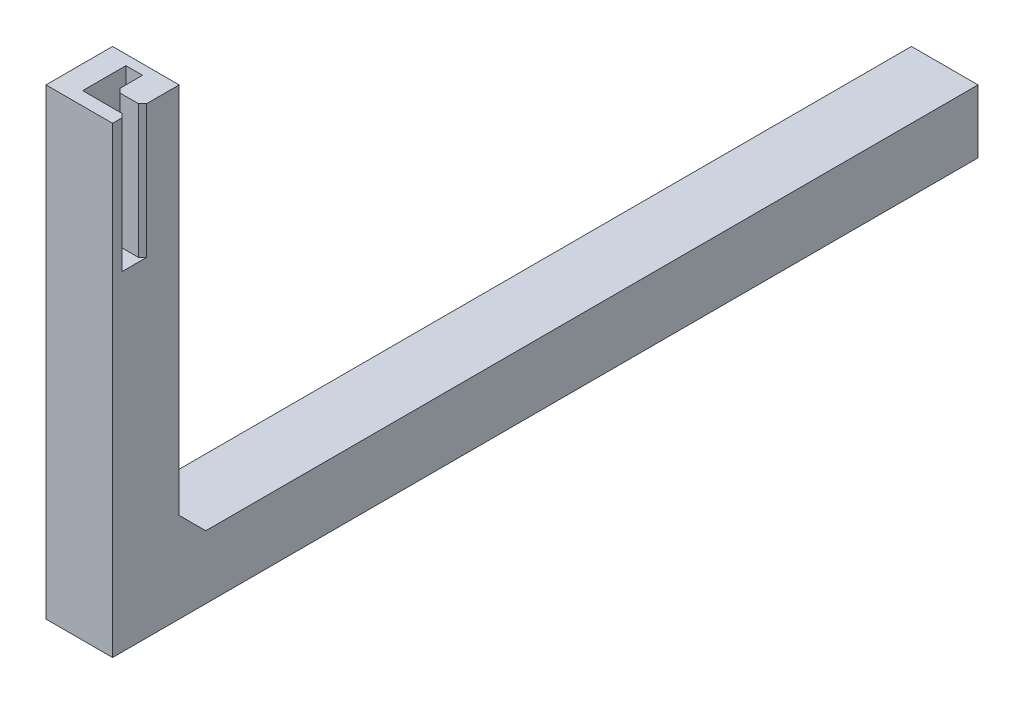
ISO-10303-21;
HEADER;
FILE_DESCRIPTION(('STEP AP214'),'2;1');
FILE_NAME('part.step','',(''),(''),'','','');
FILE_SCHEMA(('AUTOMOTIVE_DESIGN { 1 0 10303 214 1 1 1 1 }'));
ENDSEC;
DATA;
#1=APPLICATION_CONTEXT('core data for automotive mechanical design processes');
#2=APPLICATION_PROTOCOL_DEFINITION('international standard','automotive_design',2000,#1);
#3=PRODUCT_CONTEXT('',#1,'mechanical');
#4=PRODUCT('Part','Part','',(#3));
#5=PRODUCT_RELATED_PRODUCT_CATEGORY('part','',(#4));
#6=PRODUCT_DEFINITION_FORMATION('','',#4);
#7=PRODUCT_DEFINITION_CONTEXT('part definition',#1,'design');
#8=PRODUCT_DEFINITION('design','',#6,#7);
#9=PRODUCT_DEFINITION_SHAPE('','',#8);
#10=(LENGTH_UNIT() NAMED_UNIT(*) SI_UNIT(.MILLI.,.METRE.));
#11=(NAMED_UNIT(*) PLANE_ANGLE_UNIT() SI_UNIT($,.RADIAN.));
#12=(NAMED_UNIT(*) SI_UNIT($,.STERADIAN.) SOLID_ANGLE_UNIT());
#13=UNCERTAINTY_MEASURE_WITH_UNIT(LENGTH_MEASURE(1.E-05),#10,'distance_accuracy_value','');
#14=(GEOMETRIC_REPRESENTATION_CONTEXT(3) GLOBAL_UNCERTAINTY_ASSIGNED_CONTEXT((#13)) GLOBAL_UNIT_ASSIGNED_CONTEXT((#10,
#11,#12)) REPRESENTATION_CONTEXT('',''));
#15=CARTESIAN_POINT('',(0.,0.,0.));
#16=DIRECTION('',(0.,0.,1.));
#17=DIRECTION('',(1.,0.,0.));
#18=AXIS2_PLACEMENT_3D('',#15,#16,#17);
#19=CARTESIAN_POINT('',(-10.,0.,-130.));
#20=DIRECTION('',(0.,-1.,0.));
#21=DIRECTION('',(0.,0.,-1.));
#22=AXIS2_PLACEMENT_3D('',#19,#20,#21);
#23=PLANE('',#22);
#24=DIRECTION('',(0.,0.,-1.));
#25=VECTOR('',#24,1.);
#26=CARTESIAN_POINT('',(-9.5,0.,-130.));
#27=LINE('',#26,#25);
#28=CARTESIAN_POINT('',(-9.5,0.,-0.5));
#29=VERTEX_POINT('',#28);
#30=CARTESIAN_POINT('',(-9.5,0.,-129.5));
#31=VERTEX_POINT('',#30);
#32=EDGE_CURVE('E299',#29,#31,#27,.T.);
#33=ORIENTED_EDGE('',*,*,#32,.T.);
#34=DIRECTION('',(1.,0.,0.));
#35=VECTOR('',#34,1.);
#36=CARTESIAN_POINT('',(-10.,0.,-129.5));
#37=LINE('',#36,#35);
#38=CARTESIAN_POINT('',(-0.5,0.,-129.5));
#39=VERTEX_POINT('',#38);
#40=EDGE_CURVE('E302',#31,#39,#37,.T.);
#41=ORIENTED_EDGE('',*,*,#40,.T.);
#42=DIRECTION('',(0.,0.,1.));
#43=VECTOR('',#42,1.);
#44=CARTESIAN_POINT('',(-0.5,0.,0.));
#45=LINE('',#44,#43);
#46=CARTESIAN_POINT('',(-0.5,0.,-0.5));
#47=VERTEX_POINT('',#46);
#48=EDGE_CURVE('E293',#39,#47,#45,.T.);
#49=ORIENTED_EDGE('',*,*,#48,.T.);
#50=DIRECTION('',(-1.,0.,0.));
#51=VECTOR('',#50,1.);
#52=CARTESIAN_POINT('',(-10.,0.,-0.5));
#53=LINE('',#52,#51);
#54=EDGE_CURVE('E296',#47,#29,#53,.T.);
#55=ORIENTED_EDGE('',*,*,#54,.T.);
#56=EDGE_LOOP('',(#33,#41,#49,#55));
#57=FACE_BOUND('',#56,.T.);
#58=ADVANCED_FACE('F41',(#57),#23,.T.);
#59=CARTESIAN_POINT('',(-10.,0.,0.));
#60=DIRECTION('',(0.,0.,1.));
#61=DIRECTION('',(1.,0.,0.));
#62=AXIS2_PLACEMENT_3D('',#59,#60,#61);
#63=PLANE('',#62);
#64=DIRECTION('',(0.,-1.,0.));
#65=VECTOR('',#64,1.);
#66=CARTESIAN_POINT('',(-10.,0.,0.));
#67=LINE('',#66,#65);
#68=CARTESIAN_POINT('',(-10.,70.,0.));
#69=VERTEX_POINT('',#68);
#70=CARTESIAN_POINT('',(-10.,0.499999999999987,0.));
#71=VERTEX_POINT('',#70);
#72=EDGE_CURVE('E245',#69,#71,#67,.T.);
#73=ORIENTED_EDGE('',*,*,#72,.T.);
#74=DIRECTION('',(1.,0.,0.));
#75=VECTOR('',#74,1.);
#76=CARTESIAN_POINT('',(-10.,0.499999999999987,0.));
#77=LINE('',#76,#75);
#78=CARTESIAN_POINT('',(0.,0.499999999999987,0.));
#79=VERTEX_POINT('',#78);
#80=EDGE_CURVE('E313',#71,#79,#77,.T.);
#81=ORIENTED_EDGE('',*,*,#80,.T.);
#82=DIRECTION('',(0.,-1.,0.));
#83=VECTOR('',#82,1.);
#84=CARTESIAN_POINT('',(0.,0.,0.));
#85=LINE('',#84,#83);
#86=CARTESIAN_POINT('',(0.,70.,0.));
#87=VERTEX_POINT('',#86);
#88=EDGE_CURVE('E234',#87,#79,#85,.T.);
#89=ORIENTED_EDGE('',*,*,#88,.F.);
#90=DIRECTION('',(1.,0.,0.));
#91=VECTOR('',#90,1.);
#92=CARTESIAN_POINT('',(-10.,70.,0.));
#93=LINE('',#92,#91);
#94=EDGE_CURVE('E269',#69,#87,#93,.T.);
#95=ORIENTED_EDGE('',*,*,#94,.F.);
#96=EDGE_LOOP('',(#73,#81,#89,#95));
#97=FACE_BOUND('',#96,.T.);
#98=ADVANCED_FACE('F375',(#97),#63,.T.);
#99=CARTESIAN_POINT('',(-10.,70.,0.));
#100=DIRECTION('',(0.,1.,0.));
#101=DIRECTION('',(0.,0.,1.));
#102=AXIS2_PLACEMENT_3D('',#99,#100,#101);
#103=PLANE('',#102);
#104=DIRECTION('',(0.,0.,-1.));
#105=VECTOR('',#104,1.);
#106=CARTESIAN_POINT('',(-4.,70.,-8.5));
#107=LINE('',#106,#105);
#108=CARTESIAN_POINT('',(-4.,70.,-5.1));
#109=VERTEX_POINT('',#108);
#110=CARTESIAN_POINT('',(-4.,70.,-8.5));
#111=VERTEX_POINT('',#110);
#112=EDGE_CURVE('E189',#109,#111,#107,.T.);
#113=ORIENTED_EDGE('',*,*,#112,.F.);
#114=DIRECTION('',(-0.707106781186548,0.,-0.707106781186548));
#115=VECTOR('',#114,1.);
#116=CARTESIAN_POINT('',(-4.45,70.,-5.55));
#117=LINE('',#116,#115);
#118=CARTESIAN_POINT('',(-3.4,70.,-4.5));
#119=VERTEX_POINT('',#118);
#120=EDGE_CURVE('E340',#109,#119,#117,.F.);
#121=ORIENTED_EDGE('',*,*,#120,.T.);
#122=DIRECTION('',(-1.,0.,0.));
#123=VECTOR('',#122,1.);
#124=CARTESIAN_POINT('',(-4.,70.,-4.5));
#125=LINE('',#124,#123);
#126=CARTESIAN_POINT('',(-0.599999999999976,70.,-4.5));
#127=VERTEX_POINT('',#126);
#128=EDGE_CURVE('E208',#127,#119,#125,.T.);
#129=ORIENTED_EDGE('',*,*,#128,.F.);
#130=DIRECTION('',(-0.707106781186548,0.,0.707106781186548));
#131=VECTOR('',#130,1.);
#132=CARTESIAN_POINT('',(-7.54999999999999,70.,2.45000000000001));
#133=LINE('',#132,#131);
#134=CARTESIAN_POINT('',(0.,70.,-5.09999999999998));
#135=VERTEX_POINT('',#134);
#136=EDGE_CURVE('E334',#127,#135,#133,.F.);
#137=ORIENTED_EDGE('',*,*,#136,.T.);
#138=DIRECTION('',(0.,0.,1.));
#139=VECTOR('',#138,1.);
#140=CARTESIAN_POINT('',(0.,70.,0.));
#141=LINE('',#140,#139);
#142=CARTESIAN_POINT('',(0.,70.,-10.));
#143=VERTEX_POINT('',#142);
#144=EDGE_CURVE('E262',#143,#135,#141,.T.);
#145=ORIENTED_EDGE('',*,*,#144,.F.);
#146=DIRECTION('',(1.,0.,0.));
#147=VECTOR('',#146,1.);
#148=CARTESIAN_POINT('',(-10.,70.,-10.));
#149=LINE('',#148,#147);
#150=CARTESIAN_POINT('',(-10.,70.,-10.));
#151=VERTEX_POINT('',#150);
#152=EDGE_CURVE('E274',#151,#143,#149,.T.);
#153=ORIENTED_EDGE('',*,*,#152,.F.);
#154=DIRECTION('',(0.,0.,1.));
#155=VECTOR('',#154,1.);
#156=CARTESIAN_POINT('',(-10.,70.,0.));
#157=LINE('',#156,#155);
#158=EDGE_CURVE('E241',#151,#69,#157,.T.);
#159=ORIENTED_EDGE('',*,*,#158,.T.);
#160=ORIENTED_EDGE('',*,*,#94,.T.);
#161=CARTESIAN_POINT('',(0.,70.,-1.4));
#162=VERTEX_POINT('',#161);
#163=EDGE_CURVE('E261',#162,#87,#141,.T.);
#164=ORIENTED_EDGE('',*,*,#163,.F.);
#165=DIRECTION('',(0.707106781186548,0.,0.707106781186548));
#166=VECTOR('',#165,1.);
#167=CARTESIAN_POINT('',(-4.3,70.,-5.7));
#168=LINE('',#167,#166);
#169=CARTESIAN_POINT('',(-0.600000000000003,70.,-2.));
#170=VERTEX_POINT('',#169);
#171=EDGE_CURVE('E337',#162,#170,#168,.F.);
#172=ORIENTED_EDGE('',*,*,#171,.T.);
#173=DIRECTION('',(1.,0.,0.));
#174=VECTOR('',#173,1.);
#175=CARTESIAN_POINT('',(0.,70.,-2.));
#176=LINE('',#175,#174);
#177=CARTESIAN_POINT('',(-6.5,70.,-2.));
#178=VERTEX_POINT('',#177);
#179=EDGE_CURVE('E221',#178,#170,#176,.T.);
#180=ORIENTED_EDGE('',*,*,#179,.F.);
#181=DIRECTION('',(0.,0.,1.));
#182=VECTOR('',#181,1.);
#183=CARTESIAN_POINT('',(-6.5,70.,-2.));
#184=LINE('',#183,#182);
#185=CARTESIAN_POINT('',(-6.5,70.,-8.5));
#186=VERTEX_POINT('',#185);
#187=EDGE_CURVE('E217',#186,#178,#184,.T.);
#188=ORIENTED_EDGE('',*,*,#187,.F.);
#189=DIRECTION('',(-1.,0.,0.));
#190=VECTOR('',#189,1.);
#191=CARTESIAN_POINT('',(-6.5,70.,-8.5));
#192=LINE('',#191,#190);
#193=EDGE_CURVE('E214',#111,#186,#192,.T.);
#194=ORIENTED_EDGE('',*,*,#193,.F.);
#195=EDGE_LOOP('',(#113,#121,#129,#137,#145,#153,#159,#160,#164,#172,#180,#188,#194));
#196=FACE_BOUND('',#195,.T.);
#197=ADVANCED_FACE('F367',(#196),#103,.T.);
#198=CARTESIAN_POINT('',(-10.,70.,-10.));
#199=DIRECTION('',(0.,0.,-1.));
#200=DIRECTION('',(0.,1.,0.));
#201=AXIS2_PLACEMENT_3D('',#198,#199,#200);
#202=PLANE('',#201);
#203=DIRECTION('',(0.,1.,0.));
#204=VECTOR('',#203,1.);
#205=CARTESIAN_POINT('',(0.,70.,-10.));
#206=LINE('',#205,#204);
#207=CARTESIAN_POINT('',(0.,14.,-10.));
#208=VERTEX_POINT('',#207);
#209=EDGE_CURVE('E258',#208,#143,#206,.T.);
#210=ORIENTED_EDGE('',*,*,#209,.F.);
#211=DIRECTION('',(-1.,0.,0.));
#212=VECTOR('',#211,1.);
#213=CARTESIAN_POINT('',(-10.,14.,-10.));
#214=LINE('',#213,#212);
#215=CARTESIAN_POINT('',(-10.,14.,-10.));
#216=VERTEX_POINT('',#215);
#217=EDGE_CURVE('E284',#208,#216,#214,.T.);
#218=ORIENTED_EDGE('',*,*,#217,.T.);
#219=DIRECTION('',(0.,1.,0.));
#220=VECTOR('',#219,1.);
#221=CARTESIAN_POINT('',(-10.,70.,-10.));
#222=LINE('',#221,#220);
#223=EDGE_CURVE('E238',#216,#151,#222,.T.);
#224=ORIENTED_EDGE('',*,*,#223,.T.);
#225=ORIENTED_EDGE('',*,*,#152,.T.);
#226=EDGE_LOOP('',(#210,#218,#224,#225));
#227=FACE_BOUND('',#226,.T.);
#228=ADVANCED_FACE('F412',(#227),#202,.T.);
#229=CARTESIAN_POINT('',(-10.,10.,-10.));
#230=DIRECTION('',(0.,1.,0.));
#231=DIRECTION('',(0.,0.,1.));
#232=AXIS2_PLACEMENT_3D('',#229,#230,#231);
#233=PLANE('',#232);
#234=DIRECTION('',(0.,0.,1.));
#235=VECTOR('',#234,1.);
#236=CARTESIAN_POINT('',(-10.,10.,-10.));
#237=LINE('',#236,#235);
#238=CARTESIAN_POINT('',(-10.,10.,-130.));
#239=VERTEX_POINT('',#238);
#240=CARTESIAN_POINT('',(-10.,10.,-14.));
#241=VERTEX_POINT('',#240);
#242=EDGE_CURVE('E233',#239,#241,#237,.T.);
#243=ORIENTED_EDGE('',*,*,#242,.T.);
#244=DIRECTION('',(1.,0.,0.));
#245=VECTOR('',#244,1.);
#246=CARTESIAN_POINT('',(0.,10.,-14.));
#247=LINE('',#246,#245);
#248=CARTESIAN_POINT('',(0.,10.,-14.));
#249=VERTEX_POINT('',#248);
#250=EDGE_CURVE('E273',#241,#249,#247,.T.);
#251=ORIENTED_EDGE('',*,*,#250,.T.);
#252=DIRECTION('',(0.,0.,1.));
#253=VECTOR('',#252,1.);
#254=CARTESIAN_POINT('',(0.,10.,-10.));
#255=LINE('',#254,#253);
#256=CARTESIAN_POINT('',(0.,10.,-130.));
#257=VERTEX_POINT('',#256);
#258=EDGE_CURVE('E253',#257,#249,#255,.T.);
#259=ORIENTED_EDGE('',*,*,#258,.F.);
#260=DIRECTION('',(1.,0.,0.));
#261=VECTOR('',#260,1.);
#262=CARTESIAN_POINT('',(-10.,10.,-130.));
#263=LINE('',#262,#261);
#264=EDGE_CURVE('E249',#239,#257,#263,.T.);
#265=ORIENTED_EDGE('',*,*,#264,.F.);
#266=EDGE_LOOP('',(#243,#251,#259,#265));
#267=FACE_BOUND('',#266,.T.);
#268=ADVANCED_FACE('F405',(#267),#233,.T.);
#269=CARTESIAN_POINT('',(-10.,10.,-130.));
#270=DIRECTION('',(0.,0.,-1.));
#271=DIRECTION('',(-1.,0.,0.));
#272=AXIS2_PLACEMENT_3D('',#269,#270,#271);
#273=PLANE('',#272);
#274=DIRECTION('',(0.,1.,0.));
#275=VECTOR('',#274,1.);
#276=CARTESIAN_POINT('',(0.,10.,-130.));
#277=LINE('',#276,#275);
#278=CARTESIAN_POINT('',(0.,0.499999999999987,-130.));
#279=VERTEX_POINT('',#278);
#280=EDGE_CURVE('E250',#279,#257,#277,.T.);
#281=ORIENTED_EDGE('',*,*,#280,.F.);
#282=DIRECTION('',(-1.,0.,0.));
#283=VECTOR('',#282,1.);
#284=CARTESIAN_POINT('',(-10.,0.499999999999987,-130.));
#285=LINE('',#284,#283);
#286=CARTESIAN_POINT('',(-10.,0.499999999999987,-130.));
#287=VERTEX_POINT('',#286);
#288=EDGE_CURVE('E306',#279,#287,#285,.T.);
#289=ORIENTED_EDGE('',*,*,#288,.T.);
#290=DIRECTION('',(0.,1.,0.));
#291=VECTOR('',#290,1.);
#292=CARTESIAN_POINT('',(-10.,10.,-130.));
#293=LINE('',#292,#291);
#294=EDGE_CURVE('E230',#287,#239,#293,.T.);
#295=ORIENTED_EDGE('',*,*,#294,.T.);
#296=ORIENTED_EDGE('',*,*,#264,.T.);
#297=EDGE_LOOP('',(#281,#289,#295,#296));
#298=FACE_BOUND('',#297,.T.);
#299=ADVANCED_FACE('F396',(#298),#273,.T.);
#300=CARTESIAN_POINT('',(-10.,0.,0.));
#301=DIRECTION('',(-1.,0.,0.));
#302=DIRECTION('',(0.,0.,1.));
#303=AXIS2_PLACEMENT_3D('',#300,#301,#302);
#304=PLANE('',#303);
#305=ORIENTED_EDGE('',*,*,#294,.F.);
#306=DIRECTION('',(0.,0.,1.));
#307=VECTOR('',#306,1.);
#308=CARTESIAN_POINT('',(-10.,0.499999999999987,0.));
#309=LINE('',#308,#307);
#310=EDGE_CURVE('E310',#287,#71,#309,.T.);
#311=ORIENTED_EDGE('',*,*,#310,.T.);
#312=ORIENTED_EDGE('',*,*,#72,.F.);
#313=ORIENTED_EDGE('',*,*,#158,.F.);
#314=ORIENTED_EDGE('',*,*,#223,.F.);
#315=DIRECTION('',(0.,0.707106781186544,0.707106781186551));
#316=VECTOR('',#315,1.);
#317=CARTESIAN_POINT('',(-10.,10.,-14.));
#318=LINE('',#317,#316);
#319=EDGE_CURVE('E290',#216,#241,#318,.F.);
#320=ORIENTED_EDGE('',*,*,#319,.T.);
#321=ORIENTED_EDGE('',*,*,#242,.F.);
#322=EDGE_LOOP('',(#305,#311,#312,#313,#314,#320,#321));
#323=FACE_BOUND('',#322,.T.);
#324=ADVANCED_FACE('F400',(#323),#304,.T.);
#325=CARTESIAN_POINT('',(0.,0.,0.));
#326=DIRECTION('',(-1.,0.,0.));
#327=DIRECTION('',(0.,0.,1.));
#328=AXIS2_PLACEMENT_3D('',#325,#326,#327);
#329=PLANE('',#328);
#330=DIRECTION('',(0.,0.,-1.));
#331=VECTOR('',#330,1.);
#332=CARTESIAN_POINT('',(0.,50.,-4.5));
#333=LINE('',#332,#331);
#334=CARTESIAN_POINT('',(0.,50.,-1.4));
#335=VERTEX_POINT('',#334);
#336=CARTESIAN_POINT('',(0.,50.,-5.09999999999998));
#337=VERTEX_POINT('',#336);
#338=EDGE_CURVE('E66',#335,#337,#333,.T.);
#339=ORIENTED_EDGE('',*,*,#338,.F.);
#340=DIRECTION('',(0.,1.,0.));
#341=VECTOR('',#340,1.);
#342=CARTESIAN_POINT('',(0.,0.,-1.4));
#343=LINE('',#342,#341);
#344=EDGE_CURVE('E353',#335,#162,#343,.T.);
#345=ORIENTED_EDGE('',*,*,#344,.T.);
#346=ORIENTED_EDGE('',*,*,#163,.T.);
#347=ORIENTED_EDGE('',*,*,#88,.T.);
#348=DIRECTION('',(0.,0.,-1.));
#349=VECTOR('',#348,1.);
#350=CARTESIAN_POINT('',(0.,0.499999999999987,-130.));
#351=LINE('',#350,#349);
#352=EDGE_CURVE('E316',#79,#279,#351,.T.);
#353=ORIENTED_EDGE('',*,*,#352,.T.);
#354=ORIENTED_EDGE('',*,*,#280,.T.);
#355=ORIENTED_EDGE('',*,*,#258,.T.);
#356=DIRECTION('',(0.,-0.707106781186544,-0.707106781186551));
#357=VECTOR('',#356,1.);
#358=CARTESIAN_POINT('',(0.,12.0000000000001,-12.));
#359=LINE('',#358,#357);
#360=EDGE_CURVE('E287',#249,#208,#359,.F.);
#361=ORIENTED_EDGE('',*,*,#360,.T.);
#362=ORIENTED_EDGE('',*,*,#209,.T.);
#363=ORIENTED_EDGE('',*,*,#144,.T.);
#364=DIRECTION('',(0.,-1.,0.));
#365=VECTOR('',#364,1.);
#366=CARTESIAN_POINT('',(0.,0.,-5.09999999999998));
#367=LINE('',#366,#365);
#368=EDGE_CURVE('E350',#135,#337,#367,.T.);
#369=ORIENTED_EDGE('',*,*,#368,.T.);
#370=EDGE_LOOP('',(#339,#345,#346,#347,#353,#354,#355,#361,#362,#363,#369));
#371=FACE_BOUND('',#370,.T.);
#372=ADVANCED_FACE('F365',(#371),#329,.F.);
#373=CARTESIAN_POINT('',(-10.,10.,-14.));
#374=DIRECTION('',(0.,0.707106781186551,-0.707106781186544));
#375=DIRECTION('',(-1.,0.,0.));
#376=AXIS2_PLACEMENT_3D('',#373,#374,#375);
#377=PLANE('',#376);
#378=ORIENTED_EDGE('',*,*,#319,.F.);
#379=ORIENTED_EDGE('',*,*,#217,.F.);
#380=ORIENTED_EDGE('',*,*,#360,.F.);
#381=ORIENTED_EDGE('',*,*,#250,.F.);
#382=EDGE_LOOP('',(#378,#379,#380,#381));
#383=FACE_BOUND('',#382,.T.);
#384=ADVANCED_FACE('F408',(#383),#377,.T.);
#385=CARTESIAN_POINT('',(-10.,0.499999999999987,0.));
#386=DIRECTION('',(0.,0.707106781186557,-0.707106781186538));
#387=DIRECTION('',(1.,0.,0.));
#388=AXIS2_PLACEMENT_3D('',#385,#386,#387);
#389=PLANE('',#388);
#390=DIRECTION('',(0.577350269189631,0.577350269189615,0.577350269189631));
#391=VECTOR('',#390,1.);
#392=CARTESIAN_POINT('',(0.,0.499999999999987,0.));
#393=LINE('',#392,#391);
#394=EDGE_CURVE('E325',#79,#47,#393,.F.);
#395=ORIENTED_EDGE('',*,*,#394,.F.);
#396=ORIENTED_EDGE('',*,*,#80,.F.);
#397=DIRECTION('',(0.577350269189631,-0.577350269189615,-0.577350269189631));
#398=VECTOR('',#397,1.);
#399=CARTESIAN_POINT('',(-10.,0.499999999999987,0.));
#400=LINE('',#399,#398);
#401=EDGE_CURVE('E254',#29,#71,#400,.F.);
#402=ORIENTED_EDGE('',*,*,#401,.F.);
#403=ORIENTED_EDGE('',*,*,#54,.F.);
#404=EDGE_LOOP('',(#395,#396,#402,#403));
#405=FACE_BOUND('',#404,.T.);
#406=ADVANCED_FACE('F382',(#405),#389,.F.);
#407=CARTESIAN_POINT('',(-9.5,0.,-130.));
#408=DIRECTION('',(0.707106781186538,0.707106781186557,0.));
#409=DIRECTION('',(0.,0.,-1.));
#410=AXIS2_PLACEMENT_3D('',#407,#408,#409);
#411=PLANE('',#410);
#412=ORIENTED_EDGE('',*,*,#401,.T.);
#413=ORIENTED_EDGE('',*,*,#310,.F.);
#414=DIRECTION('',(0.577350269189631,-0.577350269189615,0.577350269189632));
#415=VECTOR('',#414,1.);
#416=CARTESIAN_POINT('',(-9.66666666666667,0.166666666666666,-129.666666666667));
#417=LINE('',#416,#415);
#418=EDGE_CURVE('E322',#31,#287,#417,.F.);
#419=ORIENTED_EDGE('',*,*,#418,.F.);
#420=ORIENTED_EDGE('',*,*,#32,.F.);
#421=EDGE_LOOP('',(#412,#413,#419,#420));
#422=FACE_BOUND('',#421,.T.);
#423=ADVANCED_FACE('F467',(#422),#411,.F.);
#424=CARTESIAN_POINT('',(0.,0.499999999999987,0.));
#425=DIRECTION('',(0.707106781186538,-0.707106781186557,0.));
#426=DIRECTION('',(0.,0.,1.));
#427=AXIS2_PLACEMENT_3D('',#424,#425,#426);
#428=PLANE('',#427);
#429=ORIENTED_EDGE('',*,*,#394,.T.);
#430=ORIENTED_EDGE('',*,*,#48,.F.);
#431=DIRECTION('',(-0.577350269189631,-0.577350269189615,0.577350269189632));
#432=VECTOR('',#431,1.);
#433=CARTESIAN_POINT('',(-43.3333333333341,-42.833333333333,-86.6666666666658));
#434=LINE('',#433,#432);
#435=EDGE_CURVE('E227',#279,#39,#434,.T.);
#436=ORIENTED_EDGE('',*,*,#435,.F.);
#437=ORIENTED_EDGE('',*,*,#352,.F.);
#438=EDGE_LOOP('',(#429,#430,#436,#437));
#439=FACE_BOUND('',#438,.T.);
#440=ADVANCED_FACE('F387',(#439),#428,.T.);
#441=CARTESIAN_POINT('',(-10.,0.,-129.5));
#442=DIRECTION('',(0.,0.707106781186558,0.707106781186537));
#443=DIRECTION('',(1.,0.,0.));
#444=AXIS2_PLACEMENT_3D('',#441,#442,#443);
#445=PLANE('',#444);
#446=ORIENTED_EDGE('',*,*,#418,.T.);
#447=ORIENTED_EDGE('',*,*,#288,.F.);
#448=ORIENTED_EDGE('',*,*,#435,.T.);
#449=ORIENTED_EDGE('',*,*,#40,.F.);
#450=EDGE_LOOP('',(#446,#447,#448,#449));
#451=FACE_BOUND('',#450,.T.);
#452=ADVANCED_FACE('F391',(#451),#445,.F.);
#453=CARTESIAN_POINT('',(0.,50.,-2.));
#454=DIRECTION('',(0.,0.,1.));
#455=DIRECTION('',(1.,0.,0.));
#456=AXIS2_PLACEMENT_3D('',#453,#454,#455);
#457=PLANE('',#456);
#458=ORIENTED_EDGE('',*,*,#179,.T.);
#459=DIRECTION('',(0.,-1.,0.));
#460=VECTOR('',#459,1.);
#461=CARTESIAN_POINT('',(-0.600000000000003,50.,-2.));
#462=LINE('',#461,#460);
#463=CARTESIAN_POINT('',(-0.600000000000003,50.,-2.));
#464=VERTEX_POINT('',#463);
#465=EDGE_CURVE('E58',#170,#464,#462,.T.);
#466=ORIENTED_EDGE('',*,*,#465,.T.);
#467=DIRECTION('',(1.,0.,0.));
#468=VECTOR('',#467,1.);
#469=CARTESIAN_POINT('',(0.,50.,-2.));
#470=LINE('',#469,#468);
#471=CARTESIAN_POINT('',(-6.5,50.,-2.));
#472=VERTEX_POINT('',#471);
#473=EDGE_CURVE('E195',#472,#464,#470,.T.);
#474=ORIENTED_EDGE('',*,*,#473,.F.);
#475=DIRECTION('',(0.,1.,0.));
#476=VECTOR('',#475,1.);
#477=CARTESIAN_POINT('',(-6.5,50.,-2.));
#478=LINE('',#477,#476);
#479=EDGE_CURVE('E224',#472,#178,#478,.T.);
#480=ORIENTED_EDGE('',*,*,#479,.T.);
#481=EDGE_LOOP('',(#458,#466,#474,#480));
#482=FACE_BOUND('',#481,.T.);
#483=ADVANCED_FACE('F431',(#482),#457,.F.);
#484=CARTESIAN_POINT('',(-6.5,50.,-2.));
#485=DIRECTION('',(-1.,0.,0.));
#486=DIRECTION('',(0.,0.,1.));
#487=AXIS2_PLACEMENT_3D('',#484,#485,#486);
#488=PLANE('',#487);
#489=ORIENTED_EDGE('',*,*,#187,.T.);
#490=ORIENTED_EDGE('',*,*,#479,.F.);
#491=DIRECTION('',(0.,0.,1.));
#492=VECTOR('',#491,1.);
#493=CARTESIAN_POINT('',(-6.5,50.,-2.));
#494=LINE('',#493,#492);
#495=CARTESIAN_POINT('',(-6.5,50.,-8.5));
#496=VERTEX_POINT('',#495);
#497=EDGE_CURVE('E200',#496,#472,#494,.T.);
#498=ORIENTED_EDGE('',*,*,#497,.F.);
#499=DIRECTION('',(0.,1.,0.));
#500=VECTOR('',#499,1.);
#501=CARTESIAN_POINT('',(-6.5,50.,-8.5));
#502=LINE('',#501,#500);
#503=EDGE_CURVE('E194',#496,#186,#502,.T.);
#504=ORIENTED_EDGE('',*,*,#503,.T.);
#505=EDGE_LOOP('',(#489,#490,#498,#504));
#506=FACE_BOUND('',#505,.T.);
#507=ADVANCED_FACE('F430',(#506),#488,.F.);
#508=CARTESIAN_POINT('',(-6.5,50.,-8.5));
#509=DIRECTION('',(0.,0.,-1.));
#510=DIRECTION('',(-1.,0.,0.));
#511=AXIS2_PLACEMENT_3D('',#508,#509,#510);
#512=PLANE('',#511);
#513=ORIENTED_EDGE('',*,*,#193,.T.);
#514=ORIENTED_EDGE('',*,*,#503,.F.);
#515=DIRECTION('',(-1.,0.,0.));
#516=VECTOR('',#515,1.);
#517=CARTESIAN_POINT('',(-6.5,50.,-8.5));
#518=LINE('',#517,#516);
#519=CARTESIAN_POINT('',(-4.,50.,-8.5));
#520=VERTEX_POINT('',#519);
#521=EDGE_CURVE('E175',#520,#496,#518,.T.);
#522=ORIENTED_EDGE('',*,*,#521,.F.);
#523=DIRECTION('',(0.,1.,0.));
#524=VECTOR('',#523,1.);
#525=CARTESIAN_POINT('',(-4.,50.,-8.5));
#526=LINE('',#525,#524);
#527=EDGE_CURVE('E186',#520,#111,#526,.T.);
#528=ORIENTED_EDGE('',*,*,#527,.T.);
#529=EDGE_LOOP('',(#513,#514,#522,#528));
#530=FACE_BOUND('',#529,.T.);
#531=ADVANCED_FACE('F197',(#530),#512,.F.);
#532=CARTESIAN_POINT('',(-4.,50.,-8.5));
#533=DIRECTION('',(1.,0.,0.));
#534=DIRECTION('',(0.,0.,-1.));
#535=AXIS2_PLACEMENT_3D('',#532,#533,#534);
#536=PLANE('',#535);
#537=DIRECTION('',(0.,0.,-1.));
#538=VECTOR('',#537,1.);
#539=CARTESIAN_POINT('',(-4.,50.,-8.5));
#540=LINE('',#539,#538);
#541=CARTESIAN_POINT('',(-4.,50.,-5.1));
#542=VERTEX_POINT('',#541);
#543=EDGE_CURVE('E170',#542,#520,#540,.T.);
#544=ORIENTED_EDGE('',*,*,#543,.F.);
#545=DIRECTION('',(0.,1.,0.));
#546=VECTOR('',#545,1.);
#547=CARTESIAN_POINT('',(-4.,50.,-5.1));
#548=LINE('',#547,#546);
#549=EDGE_CURVE('E319',#542,#109,#548,.T.);
#550=ORIENTED_EDGE('',*,*,#549,.T.);
#551=ORIENTED_EDGE('',*,*,#112,.T.);
#552=ORIENTED_EDGE('',*,*,#527,.F.);
#553=EDGE_LOOP('',(#544,#550,#551,#552));
#554=FACE_BOUND('',#553,.T.);
#555=ADVANCED_FACE('F187',(#554),#536,.F.);
#556=CARTESIAN_POINT('',(-4.,50.,-4.5));
#557=DIRECTION('',(0.,0.,-1.));
#558=DIRECTION('',(-1.,0.,0.));
#559=AXIS2_PLACEMENT_3D('',#556,#557,#558);
#560=PLANE('',#559);
#561=ORIENTED_EDGE('',*,*,#128,.T.);
#562=DIRECTION('',(0.,-1.,0.));
#563=VECTOR('',#562,1.);
#564=CARTESIAN_POINT('',(-3.4,50.,-4.5));
#565=LINE('',#564,#563);
#566=CARTESIAN_POINT('',(-3.4,50.,-4.5));
#567=VERTEX_POINT('',#566);
#568=EDGE_CURVE('E347',#119,#567,#565,.T.);
#569=ORIENTED_EDGE('',*,*,#568,.T.);
#570=DIRECTION('',(-1.,0.,0.));
#571=VECTOR('',#570,1.);
#572=CARTESIAN_POINT('',(-4.,50.,-4.5));
#573=LINE('',#572,#571);
#574=CARTESIAN_POINT('',(-0.599999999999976,50.,-4.5));
#575=VERTEX_POINT('',#574);
#576=EDGE_CURVE('E183',#575,#567,#573,.T.);
#577=ORIENTED_EDGE('',*,*,#576,.F.);
#578=DIRECTION('',(0.,1.,0.));
#579=VECTOR('',#578,1.);
#580=CARTESIAN_POINT('',(-0.599999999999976,50.,-4.5));
#581=LINE('',#580,#579);
#582=EDGE_CURVE('E343',#575,#127,#581,.T.);
#583=ORIENTED_EDGE('',*,*,#582,.T.);
#584=EDGE_LOOP('',(#561,#569,#577,#583));
#585=FACE_BOUND('',#584,.T.);
#586=ADVANCED_FACE('F421',(#585),#560,.F.);
#587=CARTESIAN_POINT('',(0.,50.,0.));
#588=DIRECTION('',(0.,-1.,0.));
#589=DIRECTION('',(0.,0.,-1.));
#590=AXIS2_PLACEMENT_3D('',#587,#588,#589);
#591=PLANE('',#590);
#592=ORIENTED_EDGE('',*,*,#338,.T.);
#593=DIRECTION('',(0.707106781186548,0.,-0.707106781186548));
#594=VECTOR('',#593,1.);
#595=CARTESIAN_POINT('',(-2.54999999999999,50.,-2.54999999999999));
#596=LINE('',#595,#594);
#597=EDGE_CURVE('E11',#337,#575,#596,.F.);
#598=ORIENTED_EDGE('',*,*,#597,.T.);
#599=ORIENTED_EDGE('',*,*,#576,.T.);
#600=DIRECTION('',(0.707106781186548,0.,0.707106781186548));
#601=VECTOR('',#600,1.);
#602=CARTESIAN_POINT('',(0.550000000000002,50.,-0.550000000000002));
#603=LINE('',#602,#601);
#604=EDGE_CURVE('E178',#567,#542,#603,.F.);
#605=ORIENTED_EDGE('',*,*,#604,.T.);
#606=ORIENTED_EDGE('',*,*,#543,.T.);
#607=ORIENTED_EDGE('',*,*,#521,.T.);
#608=ORIENTED_EDGE('',*,*,#497,.T.);
#609=ORIENTED_EDGE('',*,*,#473,.T.);
#610=DIRECTION('',(-0.707106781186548,0.,-0.707106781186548));
#611=VECTOR('',#610,1.);
#612=CARTESIAN_POINT('',(0.699999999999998,50.,-0.699999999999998));
#613=LINE('',#612,#611);
#614=EDGE_CURVE('E51',#464,#335,#613,.F.);
#615=ORIENTED_EDGE('',*,*,#614,.T.);
#616=EDGE_LOOP('',(#592,#598,#599,#605,#606,#607,#608,#609,#615));
#617=FACE_BOUND('',#616,.T.);
#618=ADVANCED_FACE('F172',(#617),#591,.F.);
#619=CARTESIAN_POINT('',(-4.,50.,-5.1));
#620=DIRECTION('',(0.707106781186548,0.,-0.707106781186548));
#621=DIRECTION('',(0.,1.,0.));
#622=AXIS2_PLACEMENT_3D('',#619,#620,#621);
#623=PLANE('',#622);
#624=ORIENTED_EDGE('',*,*,#604,.F.);
#625=ORIENTED_EDGE('',*,*,#568,.F.);
#626=ORIENTED_EDGE('',*,*,#120,.F.);
#627=ORIENTED_EDGE('',*,*,#549,.F.);
#628=EDGE_LOOP('',(#624,#625,#626,#627));
#629=FACE_BOUND('',#628,.T.);
#630=ADVANCED_FACE('F427',(#629),#623,.F.);
#631=CARTESIAN_POINT('',(0.,0.,-1.4));
#632=DIRECTION('',(-0.707106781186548,0.,0.707106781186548));
#633=DIRECTION('',(0.,1.,0.));
#634=AXIS2_PLACEMENT_3D('',#631,#632,#633);
#635=PLANE('',#634);
#636=ORIENTED_EDGE('',*,*,#614,.F.);
#637=ORIENTED_EDGE('',*,*,#465,.F.);
#638=ORIENTED_EDGE('',*,*,#171,.F.);
#639=ORIENTED_EDGE('',*,*,#344,.F.);
#640=EDGE_LOOP('',(#636,#637,#638,#639));
#641=FACE_BOUND('',#640,.T.);
#642=ADVANCED_FACE('F363',(#641),#635,.F.);
#643=CARTESIAN_POINT('',(-0.599999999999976,50.,-4.5));
#644=DIRECTION('',(-0.707106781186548,0.,-0.707106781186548));
#645=DIRECTION('',(0.,1.,0.));
#646=AXIS2_PLACEMENT_3D('',#643,#644,#645);
#647=PLANE('',#646);
#648=ORIENTED_EDGE('',*,*,#597,.F.);
#649=ORIENTED_EDGE('',*,*,#368,.F.);
#650=ORIENTED_EDGE('',*,*,#136,.F.);
#651=ORIENTED_EDGE('',*,*,#582,.F.);
#652=EDGE_LOOP('',(#648,#649,#650,#651));
#653=FACE_BOUND('',#652,.T.);
#654=ADVANCED_FACE('F44',(#653),#647,.F.);
#655=CLOSED_SHELL('',(#58,#98,#197,#228,#268,#299,#324,#372,#384,#406,#423,#440,#452,#483,#507,
#531,#555,#586,#618,#630,#642,#654));
#656=MANIFOLD_SOLID_BREP('B2',#655);
#657=ADVANCED_BREP_SHAPE_REPRESENTATION('',(#18,#656),#14);
#658=SHAPE_DEFINITION_REPRESENTATION(#9,#657);
ENDSEC;
END-ISO-10303-21;
